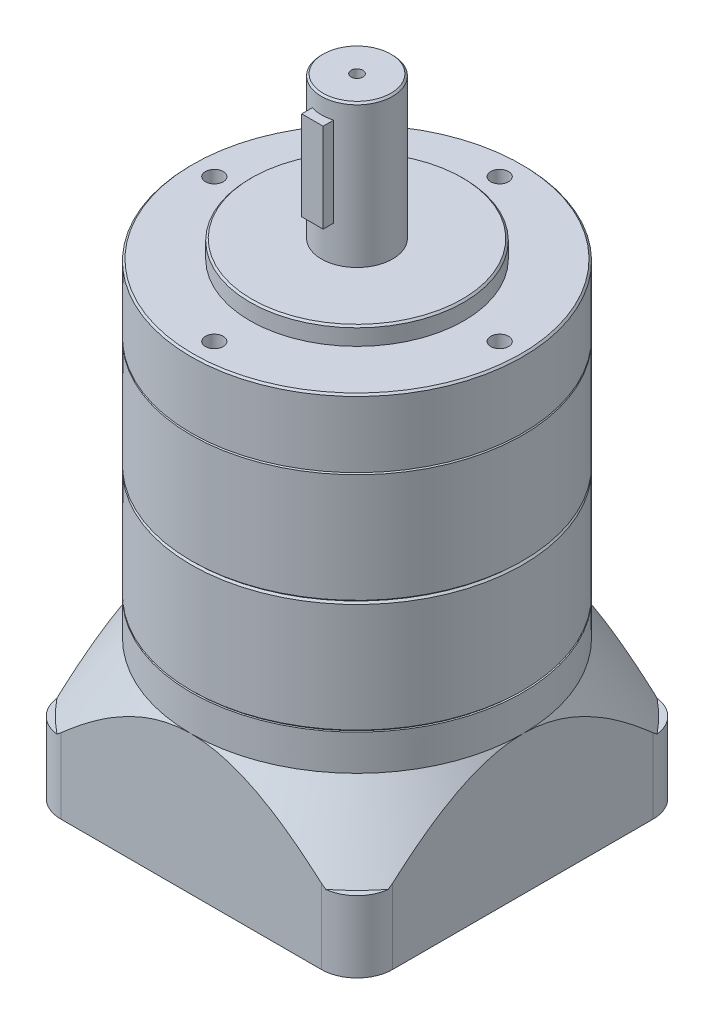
from build123d import *

# Parameters (mm, degrees)
EXTRUDE_1_DEPTH               = 49
CUT_EXTRUDE_START             = -10
SKETCH_2_OUTSIDE_W            = 123.07
SKETCH_2_OUTSIDE_H            = 123.07
SKETCH_2_OUTSIDE_R            = 46.5
CUT_EXTRUDE_3_DEPTH           = 10
CUT_EXTRUDE_3_OTHER_WAY_DEPTH = 19
CUT_EXTRUDE_3_OTHER_WAY_TAPER = 35
SKETCH_3_R                    = 46.5
EXTRUDE_2_DEPTH               = 31.5
SKETCH_15_R                   = 46.5
EXTRUDE_8_DEPTH               = 31.5
SKETCH_4_R                    = 46.5
EXTRUDE_3_DEPTH               = 19
SKETCH_6_R                    = 30
EXTRUDE_5_DEPTH               = 5
SKETCH_7_R                    = 10
EXTRUDE_6_DEPTH               = 40
CHAMFER_2_SIZE                = 0.5
PATTERN_CIRCULAR_1_COUNT      = 4
SKETCH_10_W                   = 6
SKETCH_10_H                   = 25
EXTRUDE_7_DEPTH               = 12.5
SKETCH_11_R                   = 35
CUT_EXTRUDE_4_DEPTH           = 6
SKETCH_12_R                   = 10
CUT_EXTRUDE_5_DEPTH           = 40
CHAMFER_3_SIZE                = 0.5
CHAMFER_4_SIZE                = 0.5


with BuildPart() as part:
    # Sketch 1 → Extrude 1 (new body)
    with BuildSketch(Plane(origin=(0, 0, 0), x_dir=(1, 0, 0), z_dir=(0, 1, 0))):
        with BuildLine():
            Line((-36.5, -46.5), (36.5, -46.5))
            ThreePointArc((36.5, -46.5), (43.571067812, -43.571067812), (46.5, -36.5))
            Line((46.5, -36.5), (46.5, 36.5))
            ThreePointArc((46.5, 36.5), (43.571067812, 43.571067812), (36.5, 46.5))
            Line((36.5, 46.5), (-36.5, 46.5))
            ThreePointArc((-36.5, 46.5), (-43.571067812, 43.571067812), (-46.5, 36.5))
            Line((-46.5, 36.5), (-46.5, -36.5))
            ThreePointArc((-46.5, -36.5), (-43.571067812, -43.571067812), (-36.5, -46.5))
        make_face()
    extrude(amount=EXTRUDE_1_DEPTH)

    # Sketch 2 outside → Cut-Extrude 3 (cut)
    with BuildSketch(Plane(origin=(0, 49, 0), x_dir=(1, 0, 0), z_dir=(0, 1, 0)).offset(CUT_EXTRUDE_START)):
        Rectangle(SKETCH_2_OUTSIDE_W, SKETCH_2_OUTSIDE_H)
        with Locations(Location((0, 0, 0), (0, 0, 270))):
            Circle(SKETCH_2_OUTSIDE_R, mode=Mode.SUBTRACT)
    extrude(amount=CUT_EXTRUDE_3_DEPTH, mode=Mode.SUBTRACT)

    # Sketch 2 outside → Cut-Extrude 3 other way (cut)
    with BuildSketch(Plane(origin=(0, 49, 0), x_dir=(1, 0, 0), z_dir=(0, 1, 0)).offset(CUT_EXTRUDE_START)):
        Rectangle(SKETCH_2_OUTSIDE_W, SKETCH_2_OUTSIDE_H)
        with Locations(Location((0, 0, 0), (0, 0, 270))):
            Circle(SKETCH_2_OUTSIDE_R, mode=Mode.SUBTRACT)
    extrude(amount=-CUT_EXTRUDE_3_OTHER_WAY_DEPTH, taper=CUT_EXTRUDE_3_OTHER_WAY_TAPER, mode=Mode.SUBTRACT)

    # Sketch 11 → Cut-Extrude 4 (cut)
    with BuildSketch(Plane.XZ):
        with Locations(Location((0, 0, 0), (0, 0, 270))):
            Circle(SKETCH_11_R)
    extrude(amount=-CUT_EXTRUDE_4_DEPTH, mode=Mode.SUBTRACT)

    # Sketch 12 → Cut-Extrude 5 (cut)
    with BuildSketch(Plane.XZ.offset(-6)):
        with Locations(Location((0, 0, 0), (0, 0, 90))):
            Circle(SKETCH_12_R)
    extrude(amount=-CUT_EXTRUDE_5_DEPTH, mode=Mode.SUBTRACT)


with BuildPart() as body_2:
    # Sketch 3 → Extrude 2 (new body)
    with BuildSketch(Plane(origin=(0, 49, 0), x_dir=(1, 0, 0), z_dir=(0, 1, 0))):
        with Locations(Location((0, 0, 0), (0, 0, 270))):
            Circle(SKETCH_3_R)
    extrude(amount=EXTRUDE_2_DEPTH)

    # Chamfer 4
    chamfer_4_edges = [body_2.edges().sort_by_distance(p)[0] for p in [
        (0, 49, -46.5),
        (0, 80.5, -46.5),
    ]]
    chamfer(chamfer_4_edges, length=CHAMFER_4_SIZE)


with BuildPart() as body_3:
    # Sketch 15 → Extrude 8 (new body)
    with BuildSketch(Plane(origin=(0, 80.5, 0), x_dir=(1, 0, 0), z_dir=(0, 1, 0))):
        with Locations(Location((0, 0, 0), (0, 0, 270))):
            Circle(SKETCH_15_R)
    extrude(amount=EXTRUDE_8_DEPTH)

    # Chamfer 3
    chamfer_3_edges = [body_3.edges().sort_by_distance(p)[0] for p in [
        (0, 80.5, -46.5),
        (0, 112, -46.5),
    ]]
    chamfer(chamfer_3_edges, length=CHAMFER_3_SIZE)


with BuildPart() as body_4:
    # Sketch 4 → Extrude 3 (new body)
    with BuildSketch(Plane(origin=(0, 112, 0), x_dir=(1, 0, 0), z_dir=(0, 1, 0))):
        with Locations(Location((0, 0, 0), (0, 0, 270))):
            Circle(SKETCH_4_R)
    extrude(amount=EXTRUDE_3_DEPTH)

    # Sketch 6 → Extrude 5 (add)
    with BuildSketch(Plane(origin=(0, 131, 0), x_dir=(1, 0, 0), z_dir=(0, 1, 0))):
        with Locations(Location((0, 0, 0), (0, 0, 270))):
            Circle(SKETCH_6_R)
    extrude(amount=EXTRUDE_5_DEPTH)

    # Sketch 7 → Extrude 6 (add)
    with BuildSketch(Plane(origin=(0, 136, 0), x_dir=(1, 0, 0), z_dir=(0, 1, 0))):
        with Locations(Location((0, 0, 0), (0, 0, 270))):
            Circle(SKETCH_7_R)
    extrude(amount=EXTRUDE_6_DEPTH)

    # Chamfer 2
    chamfer_2_edges = [body_4.edges().sort_by_distance(p)[0] for p in [
        (0, 176, -10),
        (0, 131, -46.5),
        (0, 136, -30),
    ]]
    chamfer(chamfer_2_edges, length=CHAMFER_2_SIZE)

    # Sketch 8 → M6x1.0 _1 (revolve, cut)
    with BuildSketch(Plane(origin=(0, 131, -40), x_dir=(0, 0, 1), z_dir=(1, 0, 0))):
        Polygon((0, 0), (0, 16.502151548), (2.5, 15), (2.5, 0), align=None)
    m6x1_0_1 = revolve(axis=Axis((0, 137.35, -40), (0, -1, 0)), mode=Mode.SUBTRACT)

    # Pattern Circular 1: M6x1.0 _1 ×4 about axis
    pattern_circular_1_axis = Axis((0, 0, 0), (0, 1, 0))
    for i in range(1, PATTERN_CIRCULAR_1_COUNT):
        add(m6x1_0_1.rotate(pattern_circular_1_axis, i * 360 / PATTERN_CIRCULAR_1_COUNT), mode=Mode.SUBTRACT)

    # Sketch 10 → Extrude 7 (add)
    with BuildSketch(Plane.XY):
        with Locations((0, 158.5)):
            Rectangle(SKETCH_10_W, SKETCH_10_H)
    extrude(amount=EXTRUDE_7_DEPTH)

    # Sketch 13 → M4x0.7 _1 (revolve, cut)
    with BuildSketch(Plane(origin=(0, 176, 0), x_dir=(0, 0, 1), z_dir=(1, 0, 0))):
        Polygon((0, 0), (0, 11.091420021), (1.65, 10.1), (1.65, 0), align=None)
    revolve(axis=Axis((0, 182.35, 0), (0, -1, 0)), mode=Mode.SUBTRACT)


solid = Compound([part.part, body_2.part, body_3.part, body_4.part])
